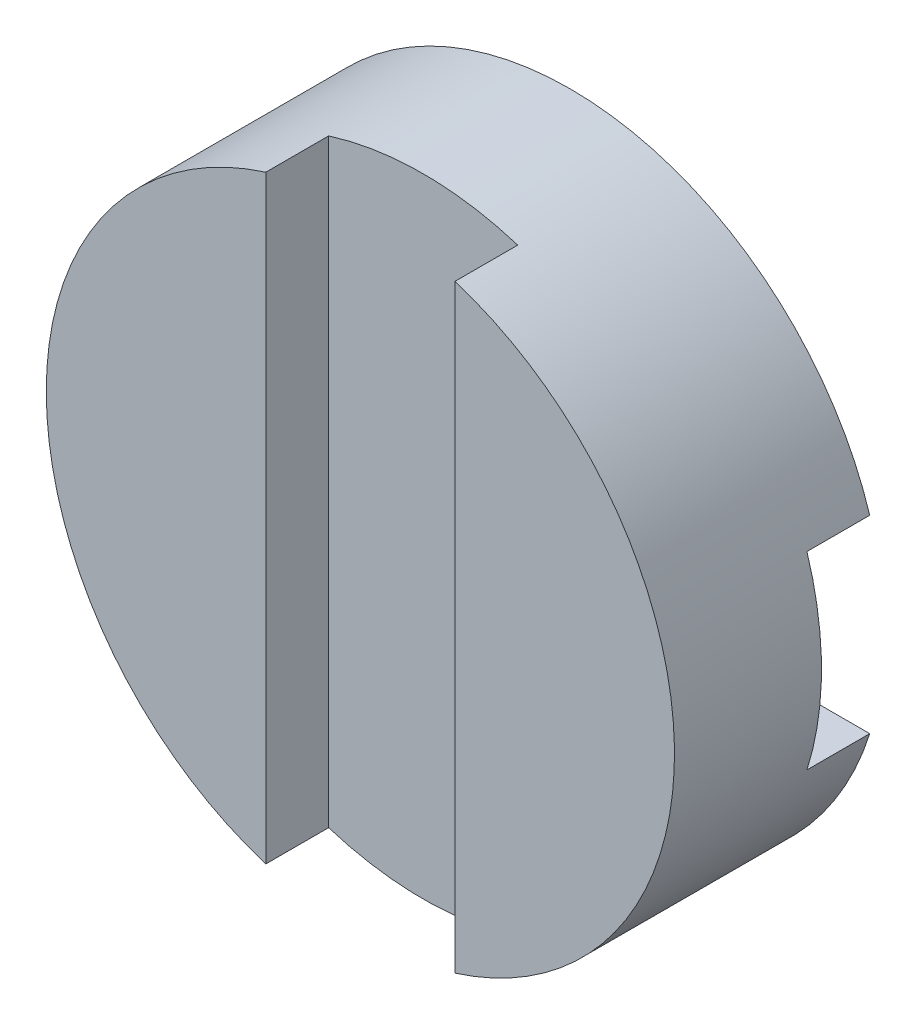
from build123d import *

# Parameters (mm, degrees)
SKETCH1_R           = 6.35
BOSS_EXTRUDE1_DEPTH = 2.1209
SKETCH2_W           = 3.8227
SKETCH2_H           = 12.7
CUT_EXTRUDE1_DEPTH  = 1.27
SKETCH3_W           = 12.7
SKETCH3_H           = 3.8227
CUT_EXTRUDE2_DEPTH  = 1.27


with BuildPart() as part:
    # Sketch1 → Boss-Extrude1 (new, symmetric)
    with BuildSketch(Plane.XY):
        Circle(SKETCH1_R)
    extrude(amount=BOSS_EXTRUDE1_DEPTH, both=True)

    # Sketch2 → Cut-Extrude1 (cut)
    with BuildSketch(Plane.XY.offset(2.1209)):
        Rectangle(SKETCH2_W, SKETCH2_H)
    extrude(amount=-CUT_EXTRUDE1_DEPTH, mode=Mode.SUBTRACT)

    # Sketch3 → Cut-Extrude2 (cut)
    with BuildSketch(Plane(origin=(0, 0, -2.1209), x_dir=(-1, 0, 0), z_dir=(0, 0, -1))):
        Rectangle(SKETCH3_W, SKETCH3_H)
    extrude(amount=-CUT_EXTRUDE2_DEPTH, mode=Mode.SUBTRACT)


solid = part.part
